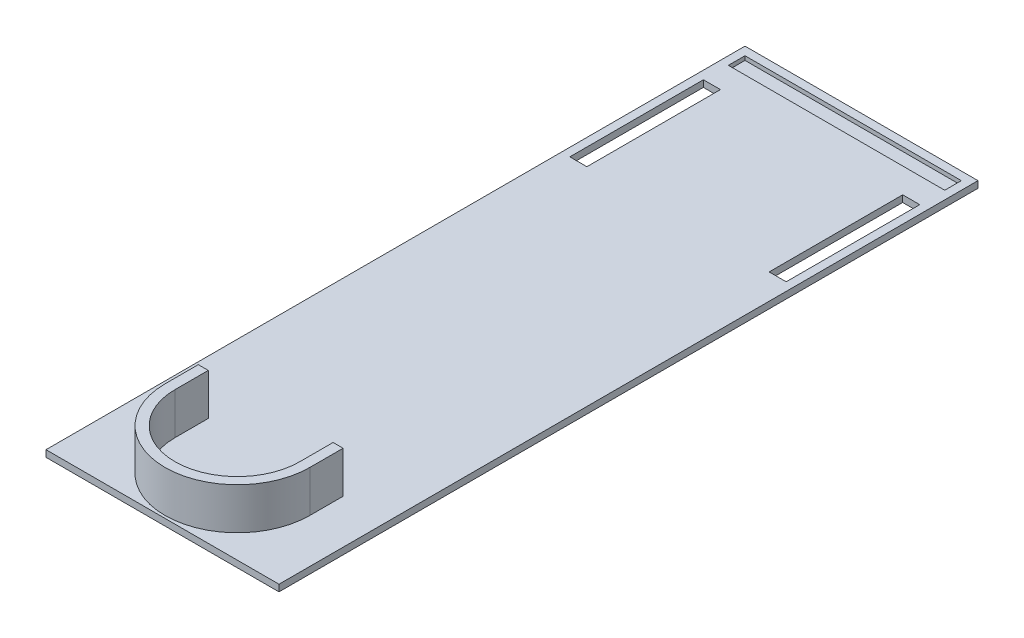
ISO-10303-21;
HEADER;
FILE_DESCRIPTION(('STEP AP214'),'2;1');
FILE_NAME('part.step','',(''),(''),'','','');
FILE_SCHEMA(('AUTOMOTIVE_DESIGN { 1 0 10303 214 1 1 1 1 }'));
ENDSEC;
DATA;
#1=APPLICATION_CONTEXT('core data for automotive mechanical design processes');
#2=APPLICATION_PROTOCOL_DEFINITION('international standard','automotive_design',2000,#1);
#3=PRODUCT_CONTEXT('',#1,'mechanical');
#4=PRODUCT('Part','Part','',(#3));
#5=PRODUCT_RELATED_PRODUCT_CATEGORY('part','',(#4));
#6=PRODUCT_DEFINITION_FORMATION('','',#4);
#7=PRODUCT_DEFINITION_CONTEXT('part definition',#1,'design');
#8=PRODUCT_DEFINITION('design','',#6,#7);
#9=PRODUCT_DEFINITION_SHAPE('','',#8);
#10=(LENGTH_UNIT() NAMED_UNIT(*) SI_UNIT(.MILLI.,.METRE.));
#11=(NAMED_UNIT(*) PLANE_ANGLE_UNIT() SI_UNIT($,.RADIAN.));
#12=(NAMED_UNIT(*) SI_UNIT($,.STERADIAN.) SOLID_ANGLE_UNIT());
#13=UNCERTAINTY_MEASURE_WITH_UNIT(LENGTH_MEASURE(1.E-05),#10,'distance_accuracy_value','');
#14=(GEOMETRIC_REPRESENTATION_CONTEXT(3) GLOBAL_UNCERTAINTY_ASSIGNED_CONTEXT((#13)) GLOBAL_UNIT_ASSIGNED_CONTEXT((#10,
#11,#12)) REPRESENTATION_CONTEXT('',''));
#15=CARTESIAN_POINT('',(0.,0.,0.));
#16=DIRECTION('',(0.,0.,1.));
#17=DIRECTION('',(1.,0.,0.));
#18=AXIS2_PLACEMENT_3D('',#15,#16,#17);
#19=CARTESIAN_POINT('',(0.,4.,0.));
#20=DIRECTION('',(0.,1.,0.));
#21=DIRECTION('',(0.,0.,1.));
#22=AXIS2_PLACEMENT_3D('',#19,#20,#21);
#23=PLANE('',#22);
#24=DIRECTION('',(0.,0.,1.));
#25=VECTOR('',#24,1.);
#26=CARTESIAN_POINT('',(-65.,4.,-205.));
#27=LINE('',#26,#25);
#28=CARTESIAN_POINT('',(-65.,4.,-205.));
#29=VERTEX_POINT('',#28);
#30=CARTESIAN_POINT('',(-65.,4.,-195.));
#31=VERTEX_POINT('',#30);
#32=EDGE_CURVE('E58',#29,#31,#27,.T.);
#33=ORIENTED_EDGE('',*,*,#32,.F.);
#34=DIRECTION('',(1.,0.,0.));
#35=VECTOR('',#34,1.);
#36=CARTESIAN_POINT('',(-65.,4.,-205.));
#37=LINE('',#36,#35);
#38=CARTESIAN_POINT('',(65.,4.,-205.));
#39=VERTEX_POINT('',#38);
#40=EDGE_CURVE('E229',#29,#39,#37,.T.);
#41=ORIENTED_EDGE('',*,*,#40,.T.);
#42=DIRECTION('',(0.,0.,1.));
#43=VECTOR('',#42,1.);
#44=CARTESIAN_POINT('',(65.,4.,-205.));
#45=LINE('',#44,#43);
#46=CARTESIAN_POINT('',(65.,4.,-195.));
#47=VERTEX_POINT('',#46);
#48=EDGE_CURVE('E232',#39,#47,#45,.T.);
#49=ORIENTED_EDGE('',*,*,#48,.T.);
#50=DIRECTION('',(1.,0.,0.));
#51=VECTOR('',#50,1.);
#52=CARTESIAN_POINT('',(-65.,4.,-195.));
#53=LINE('',#52,#51);
#54=EDGE_CURVE('E239',#31,#47,#53,.T.);
#55=ORIENTED_EDGE('',*,*,#54,.F.);
#56=EDGE_LOOP('',(#33,#41,#49,#55));
#57=FACE_BOUND('',#56,.T.);
#58=DIRECTION('',(0.,0.,1.));
#59=VECTOR('',#58,1.);
#60=CARTESIAN_POINT('',(-65.,4.,-180.));
#61=LINE('',#60,#59);
#62=CARTESIAN_POINT('',(-65.,4.,-180.));
#63=VERTEX_POINT('',#62);
#64=CARTESIAN_POINT('',(-65.,4.,-99.75));
#65=VERTEX_POINT('',#64);
#66=EDGE_CURVE('E69',#63,#65,#61,.T.);
#67=ORIENTED_EDGE('',*,*,#66,.F.);
#68=DIRECTION('',(-1.,0.,0.));
#69=VECTOR('',#68,1.);
#70=CARTESIAN_POINT('',(-65.,4.,-180.));
#71=LINE('',#70,#69);
#72=CARTESIAN_POINT('',(-54.75,4.,-180.));
#73=VERTEX_POINT('',#72);
#74=EDGE_CURVE('E260',#73,#63,#71,.T.);
#75=ORIENTED_EDGE('',*,*,#74,.F.);
#76=DIRECTION('',(0.,0.,-1.));
#77=VECTOR('',#76,1.);
#78=CARTESIAN_POINT('',(-54.75,4.,-180.));
#79=LINE('',#78,#77);
#80=CARTESIAN_POINT('',(-54.75,4.,-99.75));
#81=VERTEX_POINT('',#80);
#82=EDGE_CURVE('E256',#81,#73,#79,.T.);
#83=ORIENTED_EDGE('',*,*,#82,.F.);
#84=DIRECTION('',(1.,0.,0.));
#85=VECTOR('',#84,1.);
#86=CARTESIAN_POINT('',(-65.,4.,-99.75));
#87=LINE('',#86,#85);
#88=EDGE_CURVE('E251',#65,#81,#87,.T.);
#89=ORIENTED_EDGE('',*,*,#88,.F.);
#90=EDGE_LOOP('',(#67,#75,#83,#89));
#91=FACE_BOUND('',#90,.T.);
#92=DIRECTION('',(0.,0.,1.));
#93=VECTOR('',#92,1.);
#94=CARTESIAN_POINT('',(54.75,4.,-180.));
#95=LINE('',#94,#93);
#96=CARTESIAN_POINT('',(54.75,4.,-180.));
#97=VERTEX_POINT('',#96);
#98=CARTESIAN_POINT('',(54.75,4.,-99.75));
#99=VERTEX_POINT('',#98);
#100=EDGE_CURVE('E245',#97,#99,#95,.T.);
#101=ORIENTED_EDGE('',*,*,#100,.F.);
#102=DIRECTION('',(-1.,0.,0.));
#103=VECTOR('',#102,1.);
#104=CARTESIAN_POINT('',(54.75,4.,-180.));
#105=LINE('',#104,#103);
#106=CARTESIAN_POINT('',(65.,4.,-180.));
#107=VERTEX_POINT('',#106);
#108=EDGE_CURVE('E281',#107,#97,#105,.T.);
#109=ORIENTED_EDGE('',*,*,#108,.F.);
#110=DIRECTION('',(0.,0.,-1.));
#111=VECTOR('',#110,1.);
#112=CARTESIAN_POINT('',(65.,4.,-180.));
#113=LINE('',#112,#111);
#114=CARTESIAN_POINT('',(65.,4.,-99.75));
#115=VERTEX_POINT('',#114);
#116=EDGE_CURVE('E278',#115,#107,#113,.T.);
#117=ORIENTED_EDGE('',*,*,#116,.F.);
#118=DIRECTION('',(1.,0.,0.));
#119=VECTOR('',#118,1.);
#120=CARTESIAN_POINT('',(54.75,4.,-99.75));
#121=LINE('',#120,#119);
#122=EDGE_CURVE('E275',#99,#115,#121,.T.);
#123=ORIENTED_EDGE('',*,*,#122,.F.);
#124=EDGE_LOOP('',(#101,#109,#117,#123));
#125=FACE_BOUND('',#124,.T.);
#126=DIRECTION('',(0.,0.,-1.));
#127=VECTOR('',#126,1.);
#128=CARTESIAN_POINT('',(70.,4.,-210.));
#129=LINE('',#128,#127);
#130=CARTESIAN_POINT('',(70.,4.,210.));
#131=VERTEX_POINT('',#130);
#132=CARTESIAN_POINT('',(70.,4.,-210.));
#133=VERTEX_POINT('',#132);
#134=EDGE_CURVE('E354',#131,#133,#129,.T.);
#135=ORIENTED_EDGE('',*,*,#134,.T.);
#136=DIRECTION('',(-1.,0.,0.));
#137=VECTOR('',#136,1.);
#138=CARTESIAN_POINT('',(-70.,4.,-210.));
#139=LINE('',#138,#137);
#140=CARTESIAN_POINT('',(-70.,4.,-210.));
#141=VERTEX_POINT('',#140);
#142=EDGE_CURVE('E358',#133,#141,#139,.T.);
#143=ORIENTED_EDGE('',*,*,#142,.T.);
#144=DIRECTION('',(0.,0.,1.));
#145=VECTOR('',#144,1.);
#146=CARTESIAN_POINT('',(-70.,4.,-210.));
#147=LINE('',#146,#145);
#148=CARTESIAN_POINT('',(-70.,4.,210.));
#149=VERTEX_POINT('',#148);
#150=EDGE_CURVE('E361',#141,#149,#147,.T.);
#151=ORIENTED_EDGE('',*,*,#150,.T.);
#152=DIRECTION('',(1.,0.,0.));
#153=VECTOR('',#152,1.);
#154=CARTESIAN_POINT('',(-70.,4.,210.));
#155=LINE('',#154,#153);
#156=EDGE_CURVE('E364',#149,#131,#155,.T.);
#157=ORIENTED_EDGE('',*,*,#156,.T.);
#158=EDGE_LOOP('',(#135,#143,#151,#157));
#159=FACE_BOUND('',#158,.T.);
#160=DIRECTION('',(0.,0.,1.));
#161=VECTOR('',#160,1.);
#162=CARTESIAN_POINT('',(-43.5,4.,145.));
#163=LINE('',#162,#161);
#164=CARTESIAN_POINT('',(-43.5,4.,145.));
#165=VERTEX_POINT('',#164);
#166=CARTESIAN_POINT('',(-43.5,4.,165.));
#167=VERTEX_POINT('',#166);
#168=EDGE_CURVE('E317',#165,#167,#163,.T.);
#169=ORIENTED_EDGE('',*,*,#168,.F.);
#170=DIRECTION('',(-1.,0.,0.));
#171=VECTOR('',#170,1.);
#172=CARTESIAN_POINT('',(-37.5,4.,145.));
#173=LINE('',#172,#171);
#174=CARTESIAN_POINT('',(-37.5,4.,145.));
#175=VERTEX_POINT('',#174);
#176=EDGE_CURVE('E266',#175,#165,#173,.T.);
#177=ORIENTED_EDGE('',*,*,#176,.F.);
#178=DIRECTION('',(0.,0.,-1.));
#179=VECTOR('',#178,1.);
#180=CARTESIAN_POINT('',(-37.5,4.,165.));
#181=LINE('',#180,#179);
#182=CARTESIAN_POINT('',(-37.5,4.,165.));
#183=VERTEX_POINT('',#182);
#184=EDGE_CURVE('E296',#183,#175,#181,.T.);
#185=ORIENTED_EDGE('',*,*,#184,.F.);
#186=CARTESIAN_POINT('',(0.,4.,165.));
#187=DIRECTION('',(0.,1.,0.));
#188=DIRECTION('',(0.,0.,1.));
#189=AXIS2_PLACEMENT_3D('',#186,#187,#188);
#190=CIRCLE('',#189,37.5);
#191=CARTESIAN_POINT('',(37.5,4.,165.));
#192=VERTEX_POINT('',#191);
#193=EDGE_CURVE('E331',#183,#192,#190,.T.);
#194=ORIENTED_EDGE('',*,*,#193,.T.);
#195=DIRECTION('',(0.,0.,-1.));
#196=VECTOR('',#195,1.);
#197=CARTESIAN_POINT('',(37.5,4.,165.));
#198=LINE('',#197,#196);
#199=CARTESIAN_POINT('',(37.5,4.,145.));
#200=VERTEX_POINT('',#199);
#201=EDGE_CURVE('E328',#192,#200,#198,.T.);
#202=ORIENTED_EDGE('',*,*,#201,.T.);
#203=DIRECTION('',(1.,0.,0.));
#204=VECTOR('',#203,1.);
#205=CARTESIAN_POINT('',(37.5,4.,145.));
#206=LINE('',#205,#204);
#207=CARTESIAN_POINT('',(43.5,4.,145.));
#208=VERTEX_POINT('',#207);
#209=EDGE_CURVE('E325',#200,#208,#206,.T.);
#210=ORIENTED_EDGE('',*,*,#209,.T.);
#211=DIRECTION('',(0.,0.,1.));
#212=VECTOR('',#211,1.);
#213=CARTESIAN_POINT('',(43.5,4.,145.));
#214=LINE('',#213,#212);
#215=CARTESIAN_POINT('',(43.5,4.,165.));
#216=VERTEX_POINT('',#215);
#217=EDGE_CURVE('E322',#208,#216,#214,.T.);
#218=ORIENTED_EDGE('',*,*,#217,.T.);
#219=CARTESIAN_POINT('',(0.,4.,165.));
#220=DIRECTION('',(0.,1.,0.));
#221=DIRECTION('',(0.,0.,1.));
#222=AXIS2_PLACEMENT_3D('',#219,#220,#221);
#223=CIRCLE('',#222,43.5);
#224=EDGE_CURVE('E319',#167,#216,#223,.T.);
#225=ORIENTED_EDGE('',*,*,#224,.F.);
#226=EDGE_LOOP('',(#169,#177,#185,#194,#202,#210,#218,#225));
#227=FACE_BOUND('',#226,.T.);
#228=ADVANCED_FACE('F42',(#57,#91,#125,#159,#227),#23,.T.);
#229=CARTESIAN_POINT('',(70.,4.,-210.));
#230=DIRECTION('',(-1.,0.,0.));
#231=DIRECTION('',(0.,0.,1.));
#232=AXIS2_PLACEMENT_3D('',#229,#230,#231);
#233=PLANE('',#232);
#234=DIRECTION('',(0.,0.,-1.));
#235=VECTOR('',#234,1.);
#236=CARTESIAN_POINT('',(70.,0.,-210.));
#237=LINE('',#236,#235);
#238=CARTESIAN_POINT('',(70.,0.,210.));
#239=VERTEX_POINT('',#238);
#240=CARTESIAN_POINT('',(70.,0.,-210.));
#241=VERTEX_POINT('',#240);
#242=EDGE_CURVE('E353',#239,#241,#237,.T.);
#243=ORIENTED_EDGE('',*,*,#242,.T.);
#244=DIRECTION('',(0.,-1.,0.));
#245=VECTOR('',#244,1.);
#246=CARTESIAN_POINT('',(70.,4.,-210.));
#247=LINE('',#246,#245);
#248=EDGE_CURVE('E385',#133,#241,#247,.T.);
#249=ORIENTED_EDGE('',*,*,#248,.F.);
#250=ORIENTED_EDGE('',*,*,#134,.F.);
#251=DIRECTION('',(0.,-1.,0.));
#252=VECTOR('',#251,1.);
#253=CARTESIAN_POINT('',(70.,4.,210.));
#254=LINE('',#253,#252);
#255=EDGE_CURVE('E366',#131,#239,#254,.T.);
#256=ORIENTED_EDGE('',*,*,#255,.T.);
#257=EDGE_LOOP('',(#243,#249,#250,#256));
#258=FACE_BOUND('',#257,.T.);
#259=ADVANCED_FACE('F44',(#258),#233,.F.);
#260=CARTESIAN_POINT('',(-70.,4.,-210.));
#261=DIRECTION('',(0.,0.,1.));
#262=DIRECTION('',(1.,0.,0.));
#263=AXIS2_PLACEMENT_3D('',#260,#261,#262);
#264=PLANE('',#263);
#265=DIRECTION('',(-1.,0.,0.));
#266=VECTOR('',#265,1.);
#267=CARTESIAN_POINT('',(-70.,0.,-210.));
#268=LINE('',#267,#266);
#269=CARTESIAN_POINT('',(-70.,0.,-210.));
#270=VERTEX_POINT('',#269);
#271=EDGE_CURVE('E370',#241,#270,#268,.T.);
#272=ORIENTED_EDGE('',*,*,#271,.T.);
#273=DIRECTION('',(0.,-1.,0.));
#274=VECTOR('',#273,1.);
#275=CARTESIAN_POINT('',(-70.,4.,-210.));
#276=LINE('',#275,#274);
#277=EDGE_CURVE('E382',#141,#270,#276,.T.);
#278=ORIENTED_EDGE('',*,*,#277,.F.);
#279=ORIENTED_EDGE('',*,*,#142,.F.);
#280=ORIENTED_EDGE('',*,*,#248,.T.);
#281=EDGE_LOOP('',(#272,#278,#279,#280));
#282=FACE_BOUND('',#281,.T.);
#283=ADVANCED_FACE('F445',(#282),#264,.F.);
#284=CARTESIAN_POINT('',(-70.,4.,-210.));
#285=DIRECTION('',(1.,0.,0.));
#286=DIRECTION('',(0.,0.,-1.));
#287=AXIS2_PLACEMENT_3D('',#284,#285,#286);
#288=PLANE('',#287);
#289=DIRECTION('',(0.,0.,1.));
#290=VECTOR('',#289,1.);
#291=CARTESIAN_POINT('',(-70.,0.,-210.));
#292=LINE('',#291,#290);
#293=CARTESIAN_POINT('',(-70.,0.,210.));
#294=VERTEX_POINT('',#293);
#295=EDGE_CURVE('E373',#270,#294,#292,.T.);
#296=ORIENTED_EDGE('',*,*,#295,.T.);
#297=DIRECTION('',(0.,-1.,0.));
#298=VECTOR('',#297,1.);
#299=CARTESIAN_POINT('',(-70.,4.,210.));
#300=LINE('',#299,#298);
#301=EDGE_CURVE('E379',#149,#294,#300,.T.);
#302=ORIENTED_EDGE('',*,*,#301,.F.);
#303=ORIENTED_EDGE('',*,*,#150,.F.);
#304=ORIENTED_EDGE('',*,*,#277,.T.);
#305=EDGE_LOOP('',(#296,#302,#303,#304));
#306=FACE_BOUND('',#305,.T.);
#307=ADVANCED_FACE('F456',(#306),#288,.F.);
#308=CARTESIAN_POINT('',(-70.,4.,210.));
#309=DIRECTION('',(0.,0.,-1.));
#310=DIRECTION('',(-1.,0.,0.));
#311=AXIS2_PLACEMENT_3D('',#308,#309,#310);
#312=PLANE('',#311);
#313=DIRECTION('',(1.,0.,0.));
#314=VECTOR('',#313,1.);
#315=CARTESIAN_POINT('',(-70.,0.,210.));
#316=LINE('',#315,#314);
#317=EDGE_CURVE('E359',#294,#239,#316,.T.);
#318=ORIENTED_EDGE('',*,*,#317,.T.);
#319=ORIENTED_EDGE('',*,*,#255,.F.);
#320=ORIENTED_EDGE('',*,*,#156,.F.);
#321=ORIENTED_EDGE('',*,*,#301,.T.);
#322=EDGE_LOOP('',(#318,#319,#320,#321));
#323=FACE_BOUND('',#322,.T.);
#324=ADVANCED_FACE('F453',(#323),#312,.F.);
#325=CARTESIAN_POINT('',(0.,0.,0.));
#326=DIRECTION('',(0.,1.,0.));
#327=DIRECTION('',(0.,0.,1.));
#328=AXIS2_PLACEMENT_3D('',#325,#326,#327);
#329=PLANE('',#328);
#330=DIRECTION('',(-1.,0.,0.));
#331=VECTOR('',#330,1.);
#332=CARTESIAN_POINT('',(0.,0.,-180.));
#333=LINE('',#332,#331);
#334=CARTESIAN_POINT('',(-54.75,0.,-180.));
#335=VERTEX_POINT('',#334);
#336=CARTESIAN_POINT('',(-65.,0.,-180.));
#337=VERTEX_POINT('',#336);
#338=EDGE_CURVE('E51',#335,#337,#333,.T.);
#339=ORIENTED_EDGE('',*,*,#338,.T.);
#340=DIRECTION('',(0.,0.,1.));
#341=VECTOR('',#340,1.);
#342=CARTESIAN_POINT('',(-65.,0.,0.));
#343=LINE('',#342,#341);
#344=CARTESIAN_POINT('',(-65.,0.,-99.75));
#345=VERTEX_POINT('',#344);
#346=EDGE_CURVE('E11',#337,#345,#343,.T.);
#347=ORIENTED_EDGE('',*,*,#346,.T.);
#348=DIRECTION('',(1.,0.,0.));
#349=VECTOR('',#348,1.);
#350=CARTESIAN_POINT('',(1.35054569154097E-13,0.,-99.7499999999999));
#351=LINE('',#350,#349);
#352=CARTESIAN_POINT('',(-54.75,0.,-99.75));
#353=VERTEX_POINT('',#352);
#354=EDGE_CURVE('E400',#345,#353,#351,.T.);
#355=ORIENTED_EDGE('',*,*,#354,.T.);
#356=DIRECTION('',(0.,0.,-1.));
#357=VECTOR('',#356,1.);
#358=CARTESIAN_POINT('',(-54.75,0.,0.));
#359=LINE('',#358,#357);
#360=EDGE_CURVE('E404',#353,#335,#359,.T.);
#361=ORIENTED_EDGE('',*,*,#360,.T.);
#362=EDGE_LOOP('',(#339,#347,#355,#361));
#363=FACE_BOUND('',#362,.T.);
#364=DIRECTION('',(-1.,0.,0.));
#365=VECTOR('',#364,1.);
#366=CARTESIAN_POINT('',(0.,0.,-180.));
#367=LINE('',#366,#365);
#368=CARTESIAN_POINT('',(65.,0.,-180.));
#369=VERTEX_POINT('',#368);
#370=CARTESIAN_POINT('',(54.75,0.,-180.));
#371=VERTEX_POINT('',#370);
#372=EDGE_CURVE('E394',#369,#371,#367,.T.);
#373=ORIENTED_EDGE('',*,*,#372,.T.);
#374=DIRECTION('',(0.,0.,1.));
#375=VECTOR('',#374,1.);
#376=CARTESIAN_POINT('',(54.75,0.,0.));
#377=LINE('',#376,#375);
#378=CARTESIAN_POINT('',(54.75,0.,-99.75));
#379=VERTEX_POINT('',#378);
#380=EDGE_CURVE('E397',#371,#379,#377,.T.);
#381=ORIENTED_EDGE('',*,*,#380,.T.);
#382=DIRECTION('',(1.,0.,0.));
#383=VECTOR('',#382,1.);
#384=CARTESIAN_POINT('',(1.35054569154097E-13,0.,-99.7500000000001));
#385=LINE('',#384,#383);
#386=CARTESIAN_POINT('',(65.,0.,-99.75));
#387=VERTEX_POINT('',#386);
#388=EDGE_CURVE('E388',#379,#387,#385,.T.);
#389=ORIENTED_EDGE('',*,*,#388,.T.);
#390=DIRECTION('',(0.,0.,-1.));
#391=VECTOR('',#390,1.);
#392=CARTESIAN_POINT('',(65.,0.,0.));
#393=LINE('',#392,#391);
#394=EDGE_CURVE('E391',#387,#369,#393,.T.);
#395=ORIENTED_EDGE('',*,*,#394,.T.);
#396=EDGE_LOOP('',(#373,#381,#389,#395));
#397=FACE_BOUND('',#396,.T.);
#398=ORIENTED_EDGE('',*,*,#242,.F.);
#399=ORIENTED_EDGE('',*,*,#317,.F.);
#400=ORIENTED_EDGE('',*,*,#295,.F.);
#401=ORIENTED_EDGE('',*,*,#271,.F.);
#402=EDGE_LOOP('',(#398,#399,#400,#401));
#403=FACE_BOUND('',#402,.T.);
#404=ADVANCED_FACE('F409',(#363,#397,#403),#329,.F.);
#405=CARTESIAN_POINT('',(-37.5,29.,145.));
#406=DIRECTION('',(0.,0.,1.));
#407=DIRECTION('',(1.,0.,0.));
#408=AXIS2_PLACEMENT_3D('',#405,#406,#407);
#409=PLANE('',#408);
#410=ORIENTED_EDGE('',*,*,#176,.T.);
#411=DIRECTION('',(0.,-1.,0.));
#412=VECTOR('',#411,1.);
#413=CARTESIAN_POINT('',(-43.5,29.,145.));
#414=LINE('',#413,#412);
#415=CARTESIAN_POINT('',(-43.5,29.,145.));
#416=VERTEX_POINT('',#415);
#417=EDGE_CURVE('E351',#416,#165,#414,.T.);
#418=ORIENTED_EDGE('',*,*,#417,.F.);
#419=DIRECTION('',(-1.,0.,0.));
#420=VECTOR('',#419,1.);
#421=CARTESIAN_POINT('',(-37.5,29.,145.));
#422=LINE('',#421,#420);
#423=CARTESIAN_POINT('',(-37.5,29.,145.));
#424=VERTEX_POINT('',#423);
#425=EDGE_CURVE('E292',#424,#416,#422,.T.);
#426=ORIENTED_EDGE('',*,*,#425,.F.);
#427=DIRECTION('',(0.,-1.,0.));
#428=VECTOR('',#427,1.);
#429=CARTESIAN_POINT('',(-37.5,29.,145.));
#430=LINE('',#429,#428);
#431=EDGE_CURVE('E314',#424,#175,#430,.T.);
#432=ORIENTED_EDGE('',*,*,#431,.T.);
#433=EDGE_LOOP('',(#410,#418,#426,#432));
#434=FACE_BOUND('',#433,.T.);
#435=ADVANCED_FACE('F449',(#434),#409,.F.);
#436=CARTESIAN_POINT('',(-43.5,29.,145.));
#437=DIRECTION('',(1.,0.,0.));
#438=DIRECTION('',(0.,0.,-1.));
#439=AXIS2_PLACEMENT_3D('',#436,#437,#438);
#440=PLANE('',#439);
#441=ORIENTED_EDGE('',*,*,#168,.T.);
#442=DIRECTION('',(0.,-1.,0.));
#443=VECTOR('',#442,1.);
#444=CARTESIAN_POINT('',(-43.5,29.,165.));
#445=LINE('',#444,#443);
#446=CARTESIAN_POINT('',(-43.5,29.,165.));
#447=VERTEX_POINT('',#446);
#448=EDGE_CURVE('E348',#447,#167,#445,.T.);
#449=ORIENTED_EDGE('',*,*,#448,.F.);
#450=DIRECTION('',(0.,0.,1.));
#451=VECTOR('',#450,1.);
#452=CARTESIAN_POINT('',(-43.5,29.,145.));
#453=LINE('',#452,#451);
#454=EDGE_CURVE('E295',#416,#447,#453,.T.);
#455=ORIENTED_EDGE('',*,*,#454,.F.);
#456=ORIENTED_EDGE('',*,*,#417,.T.);
#457=EDGE_LOOP('',(#441,#449,#455,#456));
#458=FACE_BOUND('',#457,.T.);
#459=ADVANCED_FACE('F483',(#458),#440,.F.);
#460=CARTESIAN_POINT('',(0.,29.,165.));
#461=DIRECTION('',(0.,-1.,0.));
#462=DIRECTION('',(0.,0.,-1.));
#463=AXIS2_PLACEMENT_3D('',#460,#461,#462);
#464=CYLINDRICAL_SURFACE('',#463,43.5);
#465=ORIENTED_EDGE('',*,*,#224,.T.);
#466=DIRECTION('',(0.,-1.,0.));
#467=VECTOR('',#466,1.);
#468=CARTESIAN_POINT('',(43.5,29.,165.));
#469=LINE('',#468,#467);
#470=CARTESIAN_POINT('',(43.5,29.,165.));
#471=VERTEX_POINT('',#470);
#472=EDGE_CURVE('E346',#471,#216,#469,.T.);
#473=ORIENTED_EDGE('',*,*,#472,.F.);
#474=CARTESIAN_POINT('',(0.,29.,165.));
#475=DIRECTION('',(0.,1.,0.));
#476=DIRECTION('',(0.,0.,1.));
#477=AXIS2_PLACEMENT_3D('',#474,#475,#476);
#478=CIRCLE('',#477,43.5);
#479=EDGE_CURVE('E298',#447,#471,#478,.T.);
#480=ORIENTED_EDGE('',*,*,#479,.F.);
#481=ORIENTED_EDGE('',*,*,#448,.T.);
#482=EDGE_LOOP('',(#465,#473,#480,#481));
#483=FACE_BOUND('',#482,.T.);
#484=ADVANCED_FACE('F487',(#483),#464,.T.);
#485=CARTESIAN_POINT('',(43.5,29.,145.));
#486=DIRECTION('',(1.,0.,0.));
#487=DIRECTION('',(0.,0.,-1.));
#488=AXIS2_PLACEMENT_3D('',#485,#486,#487);
#489=PLANE('',#488);
#490=ORIENTED_EDGE('',*,*,#217,.F.);
#491=DIRECTION('',(0.,-1.,0.));
#492=VECTOR('',#491,1.);
#493=CARTESIAN_POINT('',(43.5,29.,145.));
#494=LINE('',#493,#492);
#495=CARTESIAN_POINT('',(43.5,29.,145.));
#496=VERTEX_POINT('',#495);
#497=EDGE_CURVE('E344',#496,#208,#494,.T.);
#498=ORIENTED_EDGE('',*,*,#497,.F.);
#499=DIRECTION('',(0.,0.,1.));
#500=VECTOR('',#499,1.);
#501=CARTESIAN_POINT('',(43.5,29.,145.));
#502=LINE('',#501,#500);
#503=EDGE_CURVE('E300',#496,#471,#502,.T.);
#504=ORIENTED_EDGE('',*,*,#503,.T.);
#505=ORIENTED_EDGE('',*,*,#472,.T.);
#506=EDGE_LOOP('',(#490,#498,#504,#505));
#507=FACE_BOUND('',#506,.T.);
#508=ADVANCED_FACE('F511',(#507),#489,.T.);
#509=CARTESIAN_POINT('',(37.5,29.,145.));
#510=DIRECTION('',(0.,0.,-1.));
#511=DIRECTION('',(-1.,0.,0.));
#512=AXIS2_PLACEMENT_3D('',#509,#510,#511);
#513=PLANE('',#512);
#514=ORIENTED_EDGE('',*,*,#209,.F.);
#515=DIRECTION('',(0.,-1.,0.));
#516=VECTOR('',#515,1.);
#517=CARTESIAN_POINT('',(37.5,29.,145.));
#518=LINE('',#517,#516);
#519=CARTESIAN_POINT('',(37.5,29.,145.));
#520=VERTEX_POINT('',#519);
#521=EDGE_CURVE('E342',#520,#200,#518,.T.);
#522=ORIENTED_EDGE('',*,*,#521,.F.);
#523=DIRECTION('',(1.,0.,0.));
#524=VECTOR('',#523,1.);
#525=CARTESIAN_POINT('',(37.5,29.,145.));
#526=LINE('',#525,#524);
#527=EDGE_CURVE('E303',#520,#496,#526,.T.);
#528=ORIENTED_EDGE('',*,*,#527,.T.);
#529=ORIENTED_EDGE('',*,*,#497,.T.);
#530=EDGE_LOOP('',(#514,#522,#528,#529));
#531=FACE_BOUND('',#530,.T.);
#532=ADVANCED_FACE('F508',(#531),#513,.T.);
#533=CARTESIAN_POINT('',(37.5,29.,165.));
#534=DIRECTION('',(-1.,0.,0.));
#535=DIRECTION('',(0.,0.,1.));
#536=AXIS2_PLACEMENT_3D('',#533,#534,#535);
#537=PLANE('',#536);
#538=ORIENTED_EDGE('',*,*,#201,.F.);
#539=DIRECTION('',(0.,-1.,0.));
#540=VECTOR('',#539,1.);
#541=CARTESIAN_POINT('',(37.5,29.,165.));
#542=LINE('',#541,#540);
#543=CARTESIAN_POINT('',(37.5,29.,165.));
#544=VERTEX_POINT('',#543);
#545=EDGE_CURVE('E340',#544,#192,#542,.T.);
#546=ORIENTED_EDGE('',*,*,#545,.F.);
#547=DIRECTION('',(0.,0.,-1.));
#548=VECTOR('',#547,1.);
#549=CARTESIAN_POINT('',(37.5,29.,165.));
#550=LINE('',#549,#548);
#551=EDGE_CURVE('E306',#544,#520,#550,.T.);
#552=ORIENTED_EDGE('',*,*,#551,.T.);
#553=ORIENTED_EDGE('',*,*,#521,.T.);
#554=EDGE_LOOP('',(#538,#546,#552,#553));
#555=FACE_BOUND('',#554,.T.);
#556=ADVANCED_FACE('F505',(#555),#537,.T.);
#557=CARTESIAN_POINT('',(0.,29.,165.));
#558=DIRECTION('',(0.,-1.,0.));
#559=DIRECTION('',(0.,0.,-1.));
#560=AXIS2_PLACEMENT_3D('',#557,#558,#559);
#561=CYLINDRICAL_SURFACE('',#560,37.5);
#562=ORIENTED_EDGE('',*,*,#193,.F.);
#563=DIRECTION('',(0.,-1.,0.));
#564=VECTOR('',#563,1.);
#565=CARTESIAN_POINT('',(-37.5,29.,165.));
#566=LINE('',#565,#564);
#567=CARTESIAN_POINT('',(-37.5,29.,165.));
#568=VERTEX_POINT('',#567);
#569=EDGE_CURVE('E337',#568,#183,#566,.T.);
#570=ORIENTED_EDGE('',*,*,#569,.F.);
#571=CARTESIAN_POINT('',(0.,29.,165.));
#572=DIRECTION('',(0.,1.,0.));
#573=DIRECTION('',(0.,0.,1.));
#574=AXIS2_PLACEMENT_3D('',#571,#572,#573);
#575=CIRCLE('',#574,37.5);
#576=EDGE_CURVE('E309',#568,#544,#575,.T.);
#577=ORIENTED_EDGE('',*,*,#576,.T.);
#578=ORIENTED_EDGE('',*,*,#545,.T.);
#579=EDGE_LOOP('',(#562,#570,#577,#578));
#580=FACE_BOUND('',#579,.T.);
#581=ADVANCED_FACE('F502',(#580),#561,.F.);
#582=CARTESIAN_POINT('',(-37.5,29.,165.));
#583=DIRECTION('',(-1.,0.,0.));
#584=DIRECTION('',(0.,0.,1.));
#585=AXIS2_PLACEMENT_3D('',#582,#583,#584);
#586=PLANE('',#585);
#587=ORIENTED_EDGE('',*,*,#184,.T.);
#588=ORIENTED_EDGE('',*,*,#431,.F.);
#589=DIRECTION('',(0.,0.,-1.));
#590=VECTOR('',#589,1.);
#591=CARTESIAN_POINT('',(-37.5,29.,165.));
#592=LINE('',#591,#590);
#593=EDGE_CURVE('E312',#568,#424,#592,.T.);
#594=ORIENTED_EDGE('',*,*,#593,.F.);
#595=ORIENTED_EDGE('',*,*,#569,.T.);
#596=EDGE_LOOP('',(#587,#588,#594,#595));
#597=FACE_BOUND('',#596,.T.);
#598=ADVANCED_FACE('F499',(#597),#586,.F.);
#599=CARTESIAN_POINT('',(0.,29.,165.));
#600=DIRECTION('',(0.,1.,0.));
#601=DIRECTION('',(0.,0.,1.));
#602=AXIS2_PLACEMENT_3D('',#599,#600,#601);
#603=PLANE('',#602);
#604=ORIENTED_EDGE('',*,*,#425,.T.);
#605=ORIENTED_EDGE('',*,*,#454,.T.);
#606=ORIENTED_EDGE('',*,*,#479,.T.);
#607=ORIENTED_EDGE('',*,*,#503,.F.);
#608=ORIENTED_EDGE('',*,*,#527,.F.);
#609=ORIENTED_EDGE('',*,*,#551,.F.);
#610=ORIENTED_EDGE('',*,*,#576,.F.);
#611=ORIENTED_EDGE('',*,*,#593,.T.);
#612=EDGE_LOOP('',(#604,#605,#606,#607,#608,#609,#610,#611));
#613=FACE_BOUND('',#612,.T.);
#614=ADVANCED_FACE('F491',(#613),#603,.T.);
#615=CARTESIAN_POINT('',(54.75,-21.4,-180.));
#616=DIRECTION('',(-1.,0.,0.));
#617=DIRECTION('',(0.,0.,1.));
#618=AXIS2_PLACEMENT_3D('',#615,#616,#617);
#619=PLANE('',#618);
#620=DIRECTION('',(0.,1.,0.));
#621=VECTOR('',#620,1.);
#622=CARTESIAN_POINT('',(54.75,-21.4,-180.));
#623=LINE('',#622,#621);
#624=EDGE_CURVE('E252',#371,#97,#623,.T.);
#625=ORIENTED_EDGE('',*,*,#624,.T.);
#626=ORIENTED_EDGE('',*,*,#100,.T.);
#627=DIRECTION('',(0.,1.,0.));
#628=VECTOR('',#627,1.);
#629=CARTESIAN_POINT('',(54.75,-21.4,-99.75));
#630=LINE('',#629,#628);
#631=EDGE_CURVE('E284',#379,#99,#630,.T.);
#632=ORIENTED_EDGE('',*,*,#631,.F.);
#633=ORIENTED_EDGE('',*,*,#380,.F.);
#634=EDGE_LOOP('',(#625,#626,#632,#633));
#635=FACE_BOUND('',#634,.T.);
#636=ADVANCED_FACE('F633',(#635),#619,.F.);
#637=CARTESIAN_POINT('',(54.75,-21.4,-180.));
#638=DIRECTION('',(0.,0.,-1.));
#639=DIRECTION('',(-1.,0.,0.));
#640=AXIS2_PLACEMENT_3D('',#637,#638,#639);
#641=PLANE('',#640);
#642=DIRECTION('',(0.,1.,0.));
#643=VECTOR('',#642,1.);
#644=CARTESIAN_POINT('',(65.,-21.4,-180.));
#645=LINE('',#644,#643);
#646=EDGE_CURVE('E286',#369,#107,#645,.T.);
#647=ORIENTED_EDGE('',*,*,#646,.T.);
#648=ORIENTED_EDGE('',*,*,#108,.T.);
#649=ORIENTED_EDGE('',*,*,#624,.F.);
#650=ORIENTED_EDGE('',*,*,#372,.F.);
#651=EDGE_LOOP('',(#647,#648,#649,#650));
#652=FACE_BOUND('',#651,.T.);
#653=ADVANCED_FACE('F624',(#652),#641,.F.);
#654=CARTESIAN_POINT('',(65.,-21.4,-180.));
#655=DIRECTION('',(1.,0.,0.));
#656=DIRECTION('',(0.,0.,-1.));
#657=AXIS2_PLACEMENT_3D('',#654,#655,#656);
#658=PLANE('',#657);
#659=DIRECTION('',(0.,1.,0.));
#660=VECTOR('',#659,1.);
#661=CARTESIAN_POINT('',(65.,-21.4,-99.75));
#662=LINE('',#661,#660);
#663=EDGE_CURVE('E288',#387,#115,#662,.T.);
#664=ORIENTED_EDGE('',*,*,#663,.T.);
#665=ORIENTED_EDGE('',*,*,#116,.T.);
#666=ORIENTED_EDGE('',*,*,#646,.F.);
#667=ORIENTED_EDGE('',*,*,#394,.F.);
#668=EDGE_LOOP('',(#664,#665,#666,#667));
#669=FACE_BOUND('',#668,.T.);
#670=ADVANCED_FACE('F434',(#669),#658,.F.);
#671=CARTESIAN_POINT('',(54.75,-21.4,-99.75));
#672=DIRECTION('',(0.,0.,1.));
#673=DIRECTION('',(1.,0.,0.));
#674=AXIS2_PLACEMENT_3D('',#671,#672,#673);
#675=PLANE('',#674);
#676=ORIENTED_EDGE('',*,*,#631,.T.);
#677=ORIENTED_EDGE('',*,*,#122,.T.);
#678=ORIENTED_EDGE('',*,*,#663,.F.);
#679=ORIENTED_EDGE('',*,*,#388,.F.);
#680=EDGE_LOOP('',(#676,#677,#678,#679));
#681=FACE_BOUND('',#680,.T.);
#682=ADVANCED_FACE('F427',(#681),#675,.F.);
#683=CARTESIAN_POINT('',(-65.,-21.4,-180.));
#684=DIRECTION('',(-1.,0.,0.));
#685=DIRECTION('',(0.,0.,1.));
#686=AXIS2_PLACEMENT_3D('',#683,#684,#685);
#687=PLANE('',#686);
#688=DIRECTION('',(0.,1.,0.));
#689=VECTOR('',#688,1.);
#690=CARTESIAN_POINT('',(-65.,-21.4,-180.));
#691=LINE('',#690,#689);
#692=EDGE_CURVE('E264',#337,#63,#691,.T.);
#693=ORIENTED_EDGE('',*,*,#692,.T.);
#694=ORIENTED_EDGE('',*,*,#66,.T.);
#695=DIRECTION('',(0.,1.,0.));
#696=VECTOR('',#695,1.);
#697=CARTESIAN_POINT('',(-65.,-21.4,-99.75));
#698=LINE('',#697,#696);
#699=EDGE_CURVE('E263',#345,#65,#698,.T.);
#700=ORIENTED_EDGE('',*,*,#699,.F.);
#701=ORIENTED_EDGE('',*,*,#346,.F.);
#702=EDGE_LOOP('',(#693,#694,#700,#701));
#703=FACE_BOUND('',#702,.T.);
#704=ADVANCED_FACE('F425',(#703),#687,.F.);
#705=CARTESIAN_POINT('',(-65.,-21.4,-180.));
#706=DIRECTION('',(0.,0.,-1.));
#707=DIRECTION('',(-1.,0.,0.));
#708=AXIS2_PLACEMENT_3D('',#705,#706,#707);
#709=PLANE('',#708);
#710=DIRECTION('',(0.,1.,0.));
#711=VECTOR('',#710,1.);
#712=CARTESIAN_POINT('',(-54.75,-21.4,-180.));
#713=LINE('',#712,#711);
#714=EDGE_CURVE('E267',#335,#73,#713,.T.);
#715=ORIENTED_EDGE('',*,*,#714,.T.);
#716=ORIENTED_EDGE('',*,*,#74,.T.);
#717=ORIENTED_EDGE('',*,*,#692,.F.);
#718=ORIENTED_EDGE('',*,*,#338,.F.);
#719=EDGE_LOOP('',(#715,#716,#717,#718));
#720=FACE_BOUND('',#719,.T.);
#721=ADVANCED_FACE('F415',(#720),#709,.F.);
#722=CARTESIAN_POINT('',(-54.75,-21.4,-180.));
#723=DIRECTION('',(1.,0.,0.));
#724=DIRECTION('',(0.,0.,-1.));
#725=AXIS2_PLACEMENT_3D('',#722,#723,#724);
#726=PLANE('',#725);
#727=DIRECTION('',(0.,1.,0.));
#728=VECTOR('',#727,1.);
#729=CARTESIAN_POINT('',(-54.75,-21.4,-99.75));
#730=LINE('',#729,#728);
#731=EDGE_CURVE('E269',#353,#81,#730,.T.);
#732=ORIENTED_EDGE('',*,*,#731,.T.);
#733=ORIENTED_EDGE('',*,*,#82,.T.);
#734=ORIENTED_EDGE('',*,*,#714,.F.);
#735=ORIENTED_EDGE('',*,*,#360,.F.);
#736=EDGE_LOOP('',(#732,#733,#734,#735));
#737=FACE_BOUND('',#736,.T.);
#738=ADVANCED_FACE('F417',(#737),#726,.F.);
#739=CARTESIAN_POINT('',(-65.,-21.4,-99.75));
#740=DIRECTION('',(0.,0.,1.));
#741=DIRECTION('',(1.,0.,0.));
#742=AXIS2_PLACEMENT_3D('',#739,#740,#741);
#743=PLANE('',#742);
#744=ORIENTED_EDGE('',*,*,#699,.T.);
#745=ORIENTED_EDGE('',*,*,#88,.T.);
#746=ORIENTED_EDGE('',*,*,#731,.F.);
#747=ORIENTED_EDGE('',*,*,#354,.F.);
#748=EDGE_LOOP('',(#744,#745,#746,#747));
#749=FACE_BOUND('',#748,.T.);
#750=ADVANCED_FACE('F424',(#749),#743,.F.);
#751=CARTESIAN_POINT('',(-65.,1.55,-205.));
#752=DIRECTION('',(-1.,0.,0.));
#753=DIRECTION('',(0.,0.,1.));
#754=AXIS2_PLACEMENT_3D('',#751,#752,#753);
#755=PLANE('',#754);
#756=ORIENTED_EDGE('',*,*,#32,.T.);
#757=DIRECTION('',(0.,1.,0.));
#758=VECTOR('',#757,1.);
#759=CARTESIAN_POINT('',(-65.,1.55,-195.));
#760=LINE('',#759,#758);
#761=CARTESIAN_POINT('',(-65.,1.55,-195.));
#762=VERTEX_POINT('',#761);
#763=EDGE_CURVE('E207',#762,#31,#760,.T.);
#764=ORIENTED_EDGE('',*,*,#763,.F.);
#765=DIRECTION('',(0.,0.,1.));
#766=VECTOR('',#765,1.);
#767=CARTESIAN_POINT('',(-65.,1.55,-205.));
#768=LINE('',#767,#766);
#769=CARTESIAN_POINT('',(-65.,1.55,-205.));
#770=VERTEX_POINT('',#769);
#771=EDGE_CURVE('E211',#770,#762,#768,.T.);
#772=ORIENTED_EDGE('',*,*,#771,.F.);
#773=DIRECTION('',(0.,1.,0.));
#774=VECTOR('',#773,1.);
#775=CARTESIAN_POINT('',(-65.,1.55,-205.));
#776=LINE('',#775,#774);
#777=EDGE_CURVE('E243',#770,#29,#776,.T.);
#778=ORIENTED_EDGE('',*,*,#777,.T.);
#779=EDGE_LOOP('',(#756,#764,#772,#778));
#780=FACE_BOUND('',#779,.T.);
#781=ADVANCED_FACE('F209',(#780),#755,.F.);
#782=CARTESIAN_POINT('',(-65.,1.55,-205.));
#783=DIRECTION('',(0.,0.,1.));
#784=DIRECTION('',(1.,0.,0.));
#785=AXIS2_PLACEMENT_3D('',#782,#783,#784);
#786=PLANE('',#785);
#787=ORIENTED_EDGE('',*,*,#40,.F.);
#788=ORIENTED_EDGE('',*,*,#777,.F.);
#789=DIRECTION('',(1.,0.,0.));
#790=VECTOR('',#789,1.);
#791=CARTESIAN_POINT('',(-65.,1.55,-205.));
#792=LINE('',#791,#790);
#793=CARTESIAN_POINT('',(65.,1.55,-205.));
#794=VERTEX_POINT('',#793);
#795=EDGE_CURVE('E216',#770,#794,#792,.T.);
#796=ORIENTED_EDGE('',*,*,#795,.T.);
#797=DIRECTION('',(0.,1.,0.));
#798=VECTOR('',#797,1.);
#799=CARTESIAN_POINT('',(65.,1.55,-205.));
#800=LINE('',#799,#798);
#801=EDGE_CURVE('E246',#794,#39,#800,.T.);
#802=ORIENTED_EDGE('',*,*,#801,.T.);
#803=EDGE_LOOP('',(#787,#788,#796,#802));
#804=FACE_BOUND('',#803,.T.);
#805=ADVANCED_FACE('F557',(#804),#786,.T.);
#806=CARTESIAN_POINT('',(65.,1.55,-205.));
#807=DIRECTION('',(-1.,0.,0.));
#808=DIRECTION('',(0.,0.,1.));
#809=AXIS2_PLACEMENT_3D('',#806,#807,#808);
#810=PLANE('',#809);
#811=ORIENTED_EDGE('',*,*,#48,.F.);
#812=ORIENTED_EDGE('',*,*,#801,.F.);
#813=DIRECTION('',(0.,0.,1.));
#814=VECTOR('',#813,1.);
#815=CARTESIAN_POINT('',(65.,1.55,-205.));
#816=LINE('',#815,#814);
#817=CARTESIAN_POINT('',(65.,1.55,-195.));
#818=VERTEX_POINT('',#817);
#819=EDGE_CURVE('E225',#794,#818,#816,.T.);
#820=ORIENTED_EDGE('',*,*,#819,.T.);
#821=DIRECTION('',(0.,1.,0.));
#822=VECTOR('',#821,1.);
#823=CARTESIAN_POINT('',(65.,1.55,-195.));
#824=LINE('',#823,#822);
#825=EDGE_CURVE('E215',#818,#47,#824,.T.);
#826=ORIENTED_EDGE('',*,*,#825,.T.);
#827=EDGE_LOOP('',(#811,#812,#820,#826));
#828=FACE_BOUND('',#827,.T.);
#829=ADVANCED_FACE('F564',(#828),#810,.T.);
#830=CARTESIAN_POINT('',(-65.,1.55,-195.));
#831=DIRECTION('',(0.,0.,1.));
#832=DIRECTION('',(1.,0.,0.));
#833=AXIS2_PLACEMENT_3D('',#830,#831,#832);
#834=PLANE('',#833);
#835=ORIENTED_EDGE('',*,*,#54,.T.);
#836=ORIENTED_EDGE('',*,*,#825,.F.);
#837=DIRECTION('',(1.,0.,0.));
#838=VECTOR('',#837,1.);
#839=CARTESIAN_POINT('',(-65.,1.55,-195.));
#840=LINE('',#839,#838);
#841=EDGE_CURVE('E220',#762,#818,#840,.T.);
#842=ORIENTED_EDGE('',*,*,#841,.F.);
#843=ORIENTED_EDGE('',*,*,#763,.T.);
#844=EDGE_LOOP('',(#835,#836,#842,#843));
#845=FACE_BOUND('',#844,.T.);
#846=ADVANCED_FACE('F221',(#845),#834,.F.);
#847=CARTESIAN_POINT('',(0.,1.55,0.));
#848=DIRECTION('',(0.,1.,0.));
#849=DIRECTION('',(0.,0.,1.));
#850=AXIS2_PLACEMENT_3D('',#847,#848,#849);
#851=PLANE('',#850);
#852=ORIENTED_EDGE('',*,*,#771,.T.);
#853=ORIENTED_EDGE('',*,*,#841,.T.);
#854=ORIENTED_EDGE('',*,*,#819,.F.);
#855=ORIENTED_EDGE('',*,*,#795,.F.);
#856=EDGE_LOOP('',(#852,#853,#854,#855));
#857=FACE_BOUND('',#856,.T.);
#858=ADVANCED_FACE('F228',(#857),#851,.T.);
#859=CLOSED_SHELL('',(#228,#259,#283,#307,#324,#404,#435,#459,#484,#508,#532,#556,#581,#598,
#614,#636,#653,#670,#682,#704,#721,#738,#750,#781,#805,#829,#846,#858));
#860=MANIFOLD_SOLID_BREP('B2',#859);
#861=ADVANCED_BREP_SHAPE_REPRESENTATION('',(#18,#860),#14);
#862=SHAPE_DEFINITION_REPRESENTATION(#9,#861);
ENDSEC;
END-ISO-10303-21;
